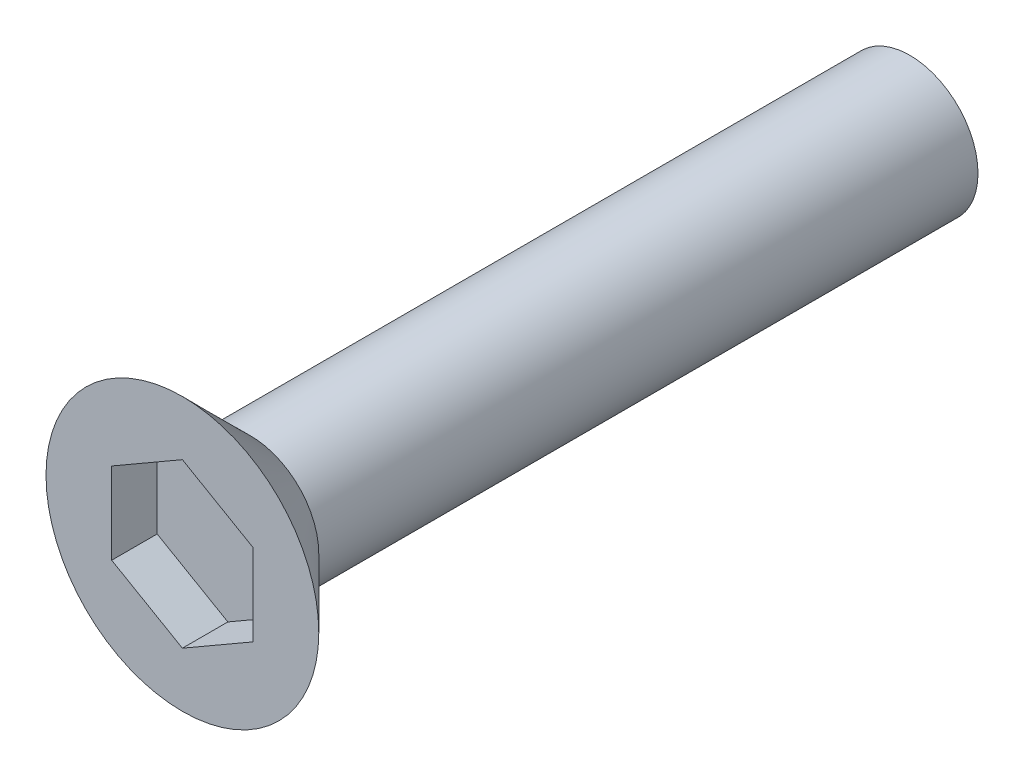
ISO-10303-21;
HEADER;
FILE_DESCRIPTION(('STEP AP214'),'2;1');
FILE_NAME('part.step','',(''),(''),'','','');
FILE_SCHEMA(('AUTOMOTIVE_DESIGN { 1 0 10303 214 1 1 1 1 }'));
ENDSEC;
DATA;
#1=APPLICATION_CONTEXT('core data for automotive mechanical design processes');
#2=APPLICATION_PROTOCOL_DEFINITION('international standard','automotive_design',2000,#1);
#3=PRODUCT_CONTEXT('',#1,'mechanical');
#4=PRODUCT('Part','Part','',(#3));
#5=PRODUCT_RELATED_PRODUCT_CATEGORY('part','',(#4));
#6=PRODUCT_DEFINITION_FORMATION('','',#4);
#7=PRODUCT_DEFINITION_CONTEXT('part definition',#1,'design');
#8=PRODUCT_DEFINITION('design','',#6,#7);
#9=PRODUCT_DEFINITION_SHAPE('','',#8);
#10=(LENGTH_UNIT() NAMED_UNIT(*) SI_UNIT(.MILLI.,.METRE.));
#11=(NAMED_UNIT(*) PLANE_ANGLE_UNIT() SI_UNIT($,.RADIAN.));
#12=(NAMED_UNIT(*) SI_UNIT($,.STERADIAN.) SOLID_ANGLE_UNIT());
#13=UNCERTAINTY_MEASURE_WITH_UNIT(LENGTH_MEASURE(1.E-05),#10,'distance_accuracy_value','');
#14=(GEOMETRIC_REPRESENTATION_CONTEXT(3) GLOBAL_UNCERTAINTY_ASSIGNED_CONTEXT((#13)) GLOBAL_UNIT_ASSIGNED_CONTEXT((#10,
#11,#12)) REPRESENTATION_CONTEXT('',''));
#15=CARTESIAN_POINT('',(0.,0.,0.));
#16=DIRECTION('',(0.,0.,1.));
#17=DIRECTION('',(1.,0.,0.));
#18=AXIS2_PLACEMENT_3D('',#15,#16,#17);
#19=CARTESIAN_POINT('',(0.,0.,30.));
#20=DIRECTION('',(0.,0.,-1.));
#21=DIRECTION('',(-1.,0.,0.));
#22=AXIS2_PLACEMENT_3D('',#19,#20,#21);
#23=CYLINDRICAL_SURFACE('',#22,1.5);
#24=CARTESIAN_POINT('',(0.,0.,15.75));
#25=DIRECTION('',(0.,0.,1.));
#26=DIRECTION('',(1.,0.,0.));
#27=AXIS2_PLACEMENT_3D('',#24,#25,#26);
#28=CIRCLE('',#27,1.5);
#29=CARTESIAN_POINT('',(1.5,0.,15.75));
#30=VERTEX_POINT('',#29);
#31=EDGE_CURVE('E21',#30,#30,#28,.F.);
#32=ORIENTED_EDGE('',*,*,#31,.F.);
#33=EDGE_LOOP('',(#32));
#34=FACE_BOUND('',#33,.T.);
#35=CARTESIAN_POINT('',(0.,0.,30.25));
#36=DIRECTION('',(0.,0.,1.));
#37=DIRECTION('',(1.,0.,0.));
#38=AXIS2_PLACEMENT_3D('',#35,#36,#37);
#39=CIRCLE('',#38,1.5);
#40=CARTESIAN_POINT('',(1.5,0.,30.25));
#41=VERTEX_POINT('',#40);
#42=EDGE_CURVE('E11',#41,#41,#39,.F.);
#43=ORIENTED_EDGE('',*,*,#42,.T.);
#44=EDGE_LOOP('',(#43));
#45=FACE_BOUND('',#44,.T.);
#46=ADVANCED_FACE('F17',(#34,#45),#23,.T.);
#47=CARTESIAN_POINT('',(0.,0.,31.75));
#48=DIRECTION('',(0.,0.,-1.));
#49=DIRECTION('',(-1.,0.,0.));
#50=AXIS2_PLACEMENT_3D('',#47,#48,#49);
#51=PLANE('',#50);
#52=DIRECTION('',(-0.866025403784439,0.5,0.));
#53=VECTOR('',#52,1.);
#54=CARTESIAN_POINT('',(1.555,0.897779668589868,31.75));
#55=LINE('',#54,#53);
#56=CARTESIAN_POINT('',(1.555,0.897779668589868,31.75));
#57=VERTEX_POINT('',#56);
#58=CARTESIAN_POINT('',(0.,1.79555933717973,31.75));
#59=VERTEX_POINT('',#58);
#60=EDGE_CURVE('E107',#57,#59,#55,.T.);
#61=ORIENTED_EDGE('',*,*,#60,.F.);
#62=DIRECTION('',(0.,1.,0.));
#63=VECTOR('',#62,1.);
#64=CARTESIAN_POINT('',(1.555,-0.897779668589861,31.75));
#65=LINE('',#64,#63);
#66=CARTESIAN_POINT('',(1.555,-0.897779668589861,31.75));
#67=VERTEX_POINT('',#66);
#68=EDGE_CURVE('E112',#67,#57,#65,.T.);
#69=ORIENTED_EDGE('',*,*,#68,.F.);
#70=DIRECTION('',(0.866025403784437,0.5,0.));
#71=VECTOR('',#70,1.);
#72=CARTESIAN_POINT('',(0.,-1.79555933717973,31.75));
#73=LINE('',#72,#71);
#74=CARTESIAN_POINT('',(0.,-1.79555933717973,31.75));
#75=VERTEX_POINT('',#74);
#76=EDGE_CURVE('E106',#75,#67,#73,.T.);
#77=ORIENTED_EDGE('',*,*,#76,.F.);
#78=DIRECTION('',(0.86602540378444,-0.5,0.));
#79=VECTOR('',#78,1.);
#80=CARTESIAN_POINT('',(-1.555,-0.897779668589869,31.75));
#81=LINE('',#80,#79);
#82=CARTESIAN_POINT('',(-1.555,-0.897779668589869,31.75));
#83=VERTEX_POINT('',#82);
#84=EDGE_CURVE('E33',#83,#75,#81,.T.);
#85=ORIENTED_EDGE('',*,*,#84,.F.);
#86=DIRECTION('',(0.,-1.,0.));
#87=VECTOR('',#86,1.);
#88=CARTESIAN_POINT('',(-1.555,0.897779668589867,31.75));
#89=LINE('',#88,#87);
#90=CARTESIAN_POINT('',(-1.555,0.897779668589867,31.75));
#91=VERTEX_POINT('',#90);
#92=EDGE_CURVE('E82',#91,#83,#89,.T.);
#93=ORIENTED_EDGE('',*,*,#92,.F.);
#94=DIRECTION('',(-0.866025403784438,-0.5,0.));
#95=VECTOR('',#94,1.);
#96=CARTESIAN_POINT('',(0.,1.79555933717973,31.75));
#97=LINE('',#96,#95);
#98=EDGE_CURVE('E111',#59,#91,#97,.T.);
#99=ORIENTED_EDGE('',*,*,#98,.F.);
#100=EDGE_LOOP('',(#61,#69,#77,#85,#93,#99));
#101=FACE_BOUND('',#100,.T.);
#102=CARTESIAN_POINT('',(0.,0.,31.75));
#103=DIRECTION('',(0.,0.,-1.));
#104=DIRECTION('',(1.,0.,0.));
#105=AXIS2_PLACEMENT_3D('',#102,#103,#104);
#106=CIRCLE('',#105,3.);
#107=CARTESIAN_POINT('',(3.,0.,31.75));
#108=VERTEX_POINT('',#107);
#109=EDGE_CURVE('E26',#108,#108,#106,.T.);
#110=ORIENTED_EDGE('',*,*,#109,.F.);
#111=EDGE_LOOP('',(#110));
#112=FACE_BOUND('',#111,.T.);
#113=ADVANCED_FACE('F135',(#101,#112),#51,.F.);
#114=CARTESIAN_POINT('',(0.,0.,30.));
#115=DIRECTION('',(0.,0.,1.));
#116=DIRECTION('',(1.,0.,0.));
#117=AXIS2_PLACEMENT_3D('',#114,#115,#116);
#118=CONICAL_SURFACE('',#117,1.25,0.785398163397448);
#119=ORIENTED_EDGE('',*,*,#109,.T.);
#120=EDGE_LOOP('',(#119));
#121=FACE_BOUND('',#120,.T.);
#122=ORIENTED_EDGE('',*,*,#42,.F.);
#123=EDGE_LOOP('',(#122));
#124=FACE_BOUND('',#123,.T.);
#125=ADVANCED_FACE('F19',(#121,#124),#118,.T.);
#126=CARTESIAN_POINT('',(1.555,-0.897779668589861,30.75));
#127=DIRECTION('',(1.,0.,0.));
#128=DIRECTION('',(0.,1.,0.));
#129=AXIS2_PLACEMENT_3D('',#126,#127,#128);
#130=PLANE('',#129);
#131=ORIENTED_EDGE('',*,*,#68,.T.);
#132=DIRECTION('',(0.,0.,1.));
#133=VECTOR('',#132,1.);
#134=CARTESIAN_POINT('',(1.555,0.897779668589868,30.75));
#135=LINE('',#134,#133);
#136=CARTESIAN_POINT('',(1.555,0.897779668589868,30.75));
#137=VERTEX_POINT('',#136);
#138=EDGE_CURVE('E66',#137,#57,#135,.T.);
#139=ORIENTED_EDGE('',*,*,#138,.F.);
#140=DIRECTION('',(0.,1.,0.));
#141=VECTOR('',#140,1.);
#142=CARTESIAN_POINT('',(1.555,-0.897779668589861,30.75));
#143=LINE('',#142,#141);
#144=CARTESIAN_POINT('',(1.555,-0.897779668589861,30.75));
#145=VERTEX_POINT('',#144);
#146=EDGE_CURVE('E103',#145,#137,#143,.T.);
#147=ORIENTED_EDGE('',*,*,#146,.F.);
#148=DIRECTION('',(0.,0.,1.));
#149=VECTOR('',#148,1.);
#150=CARTESIAN_POINT('',(1.555,-0.897779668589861,30.75));
#151=LINE('',#150,#149);
#152=EDGE_CURVE('E42',#145,#67,#151,.T.);
#153=ORIENTED_EDGE('',*,*,#152,.T.);
#154=EDGE_LOOP('',(#131,#139,#147,#153));
#155=FACE_BOUND('',#154,.T.);
#156=ADVANCED_FACE('F145',(#155),#130,.F.);
#157=CARTESIAN_POINT('',(1.555,0.897779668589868,30.75));
#158=DIRECTION('',(0.5,0.866025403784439,0.));
#159=DIRECTION('',(-0.866025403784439,0.5,0.));
#160=AXIS2_PLACEMENT_3D('',#157,#158,#159);
#161=PLANE('',#160);
#162=ORIENTED_EDGE('',*,*,#60,.T.);
#163=DIRECTION('',(0.,0.,1.));
#164=VECTOR('',#163,1.);
#165=CARTESIAN_POINT('',(0.,1.79555933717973,30.75));
#166=LINE('',#165,#164);
#167=CARTESIAN_POINT('',(0.,1.79555933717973,30.75));
#168=VERTEX_POINT('',#167);
#169=EDGE_CURVE('E127',#168,#59,#166,.T.);
#170=ORIENTED_EDGE('',*,*,#169,.F.);
#171=DIRECTION('',(-0.866025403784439,0.5,0.));
#172=VECTOR('',#171,1.);
#173=CARTESIAN_POINT('',(1.555,0.897779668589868,30.75));
#174=LINE('',#173,#172);
#175=EDGE_CURVE('E105',#137,#168,#174,.T.);
#176=ORIENTED_EDGE('',*,*,#175,.F.);
#177=ORIENTED_EDGE('',*,*,#138,.T.);
#178=EDGE_LOOP('',(#162,#170,#176,#177));
#179=FACE_BOUND('',#178,.T.);
#180=ADVANCED_FACE('F151',(#179),#161,.F.);
#181=CARTESIAN_POINT('',(0.,1.79555933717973,30.75));
#182=DIRECTION('',(-0.5,0.866025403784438,0.));
#183=DIRECTION('',(-0.866025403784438,-0.5,0.));
#184=AXIS2_PLACEMENT_3D('',#181,#182,#183);
#185=PLANE('',#184);
#186=ORIENTED_EDGE('',*,*,#98,.T.);
#187=DIRECTION('',(0.,0.,1.));
#188=VECTOR('',#187,1.);
#189=CARTESIAN_POINT('',(-1.555,0.897779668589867,30.75));
#190=LINE('',#189,#188);
#191=CARTESIAN_POINT('',(-1.555,0.897779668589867,30.75));
#192=VERTEX_POINT('',#191);
#193=EDGE_CURVE('E84',#192,#91,#190,.T.);
#194=ORIENTED_EDGE('',*,*,#193,.F.);
#195=DIRECTION('',(-0.866025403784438,-0.5,0.));
#196=VECTOR('',#195,1.);
#197=CARTESIAN_POINT('',(0.,1.79555933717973,30.75));
#198=LINE('',#197,#196);
#199=EDGE_CURVE('E95',#168,#192,#198,.T.);
#200=ORIENTED_EDGE('',*,*,#199,.F.);
#201=ORIENTED_EDGE('',*,*,#169,.T.);
#202=EDGE_LOOP('',(#186,#194,#200,#201));
#203=FACE_BOUND('',#202,.T.);
#204=ADVANCED_FACE('F154',(#203),#185,.F.);
#205=CARTESIAN_POINT('',(-1.555,0.897779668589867,30.75));
#206=DIRECTION('',(-1.,0.,0.));
#207=DIRECTION('',(0.,-1.,0.));
#208=AXIS2_PLACEMENT_3D('',#205,#206,#207);
#209=PLANE('',#208);
#210=ORIENTED_EDGE('',*,*,#92,.T.);
#211=DIRECTION('',(0.,0.,1.));
#212=VECTOR('',#211,1.);
#213=CARTESIAN_POINT('',(-1.555,-0.897779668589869,30.75));
#214=LINE('',#213,#212);
#215=CARTESIAN_POINT('',(-1.555,-0.897779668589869,30.75));
#216=VERTEX_POINT('',#215);
#217=EDGE_CURVE('E77',#216,#83,#214,.T.);
#218=ORIENTED_EDGE('',*,*,#217,.F.);
#219=DIRECTION('',(0.,-1.,0.));
#220=VECTOR('',#219,1.);
#221=CARTESIAN_POINT('',(-1.555,0.897779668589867,30.75));
#222=LINE('',#221,#220);
#223=EDGE_CURVE('E80',#192,#216,#222,.T.);
#224=ORIENTED_EDGE('',*,*,#223,.F.);
#225=ORIENTED_EDGE('',*,*,#193,.T.);
#226=EDGE_LOOP('',(#210,#218,#224,#225));
#227=FACE_BOUND('',#226,.T.);
#228=ADVANCED_FACE('F79',(#227),#209,.F.);
#229=CARTESIAN_POINT('',(-1.555,-0.897779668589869,30.75));
#230=DIRECTION('',(-0.5,-0.86602540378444,0.));
#231=DIRECTION('',(0.86602540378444,-0.5,0.));
#232=AXIS2_PLACEMENT_3D('',#229,#230,#231);
#233=PLANE('',#232);
#234=ORIENTED_EDGE('',*,*,#84,.T.);
#235=DIRECTION('',(0.,0.,1.));
#236=VECTOR('',#235,1.);
#237=CARTESIAN_POINT('',(0.,-1.79555933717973,30.75));
#238=LINE('',#237,#236);
#239=CARTESIAN_POINT('',(0.,-1.79555933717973,30.75));
#240=VERTEX_POINT('',#239);
#241=EDGE_CURVE('E85',#240,#75,#238,.T.);
#242=ORIENTED_EDGE('',*,*,#241,.F.);
#243=DIRECTION('',(0.86602540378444,-0.5,0.));
#244=VECTOR('',#243,1.);
#245=CARTESIAN_POINT('',(-1.555,-0.897779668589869,30.75));
#246=LINE('',#245,#244);
#247=EDGE_CURVE('E92',#216,#240,#246,.T.);
#248=ORIENTED_EDGE('',*,*,#247,.F.);
#249=ORIENTED_EDGE('',*,*,#217,.T.);
#250=EDGE_LOOP('',(#234,#242,#248,#249));
#251=FACE_BOUND('',#250,.T.);
#252=ADVANCED_FACE('F97',(#251),#233,.F.);
#253=CARTESIAN_POINT('',(0.,-1.79555933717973,30.75));
#254=DIRECTION('',(0.5,-0.866025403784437,0.));
#255=DIRECTION('',(0.866025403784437,0.5,0.));
#256=AXIS2_PLACEMENT_3D('',#253,#254,#255);
#257=PLANE('',#256);
#258=ORIENTED_EDGE('',*,*,#76,.T.);
#259=ORIENTED_EDGE('',*,*,#152,.F.);
#260=DIRECTION('',(0.866025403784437,0.5,0.));
#261=VECTOR('',#260,1.);
#262=CARTESIAN_POINT('',(0.,-1.79555933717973,30.75));
#263=LINE('',#262,#261);
#264=EDGE_CURVE('E98',#240,#145,#263,.T.);
#265=ORIENTED_EDGE('',*,*,#264,.F.);
#266=ORIENTED_EDGE('',*,*,#241,.T.);
#267=EDGE_LOOP('',(#258,#259,#265,#266));
#268=FACE_BOUND('',#267,.T.);
#269=ADVANCED_FACE('F163',(#268),#257,.F.);
#270=CARTESIAN_POINT('',(0.,0.,30.75));
#271=DIRECTION('',(0.,0.,1.));
#272=DIRECTION('',(1.,0.,0.));
#273=AXIS2_PLACEMENT_3D('',#270,#271,#272);
#274=PLANE('',#273);
#275=ORIENTED_EDGE('',*,*,#146,.T.);
#276=ORIENTED_EDGE('',*,*,#175,.T.);
#277=ORIENTED_EDGE('',*,*,#199,.T.);
#278=ORIENTED_EDGE('',*,*,#223,.T.);
#279=ORIENTED_EDGE('',*,*,#247,.T.);
#280=ORIENTED_EDGE('',*,*,#264,.T.);
#281=EDGE_LOOP('',(#275,#276,#277,#278,#279,#280));
#282=FACE_BOUND('',#281,.T.);
#283=ADVANCED_FACE('F91',(#282),#274,.T.);
#284=CARTESIAN_POINT('',(0.,0.,15.75));
#285=DIRECTION('',(0.,0.,1.));
#286=DIRECTION('',(1.,0.,0.));
#287=AXIS2_PLACEMENT_3D('',#284,#285,#286);
#288=PLANE('',#287);
#289=ORIENTED_EDGE('',*,*,#31,.T.);
#290=EDGE_LOOP('',(#289));
#291=FACE_BOUND('',#290,.T.);
#292=ADVANCED_FACE('F168',(#291),#288,.F.);
#293=CLOSED_SHELL('',(#46,#113,#125,#156,#180,#204,#228,#252,#269,#283,#292));
#294=MANIFOLD_SOLID_BREP('B1',#293);
#295=ADVANCED_BREP_SHAPE_REPRESENTATION('',(#18,#294),#14);
#296=SHAPE_DEFINITION_REPRESENTATION(#9,#295);
ENDSEC;
END-ISO-10303-21;
